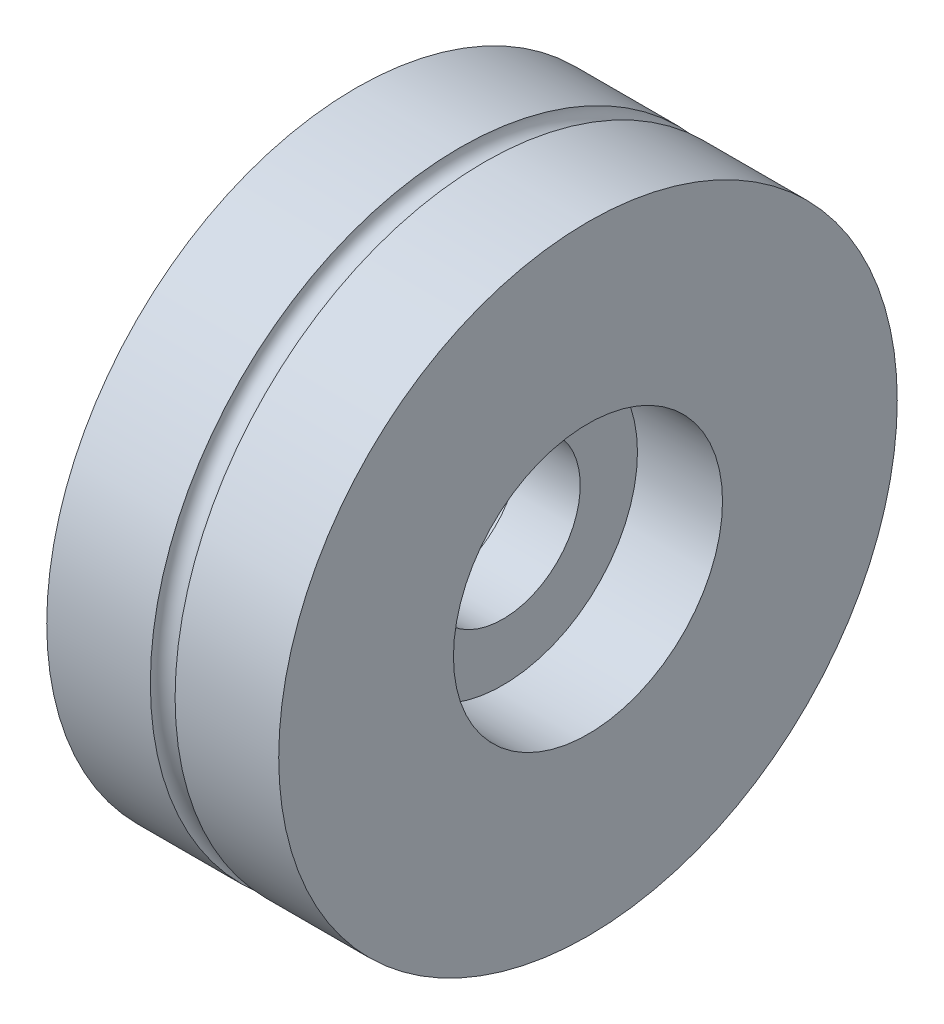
from build123d import *


with BuildPart() as part:
    # Sketch1 → Revolve1 (revolve)
    with BuildSketch(Plane.XY, mode=Mode.PRIVATE) as revolve1_sk:
        with BuildLine():
            Line((-2.54, 6.35), (2.54, 6.35))
            Line((2.54, 6.35), (2.54, 11.049))
            Line((2.54, 11.049), (9.525, 11.049))
            Line((9.525, 11.049), (9.525, 25.4))
            Line((9.525, 25.4), (1.016, 25.4))
            ThreePointArc((1.016, 25.4), (0, 24.384), (-1.016, 25.4))
            Line((-1.016, 25.4), (-9.525, 25.4))
            Line((-9.525, 25.4), (-9.525, 11.049))
            Line((-9.525, 11.049), (-2.54, 11.049))
            Line((-2.54, 11.049), (-2.54, 6.35))
        make_face()
    revolve(revolve1_sk.sketch.rotate(Axis((-6.029879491, 0, 0), (1, 0, 0)), 90), axis=Axis((-6.029879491, 0, 0), (1, 0, 0)))


solid = part.part
